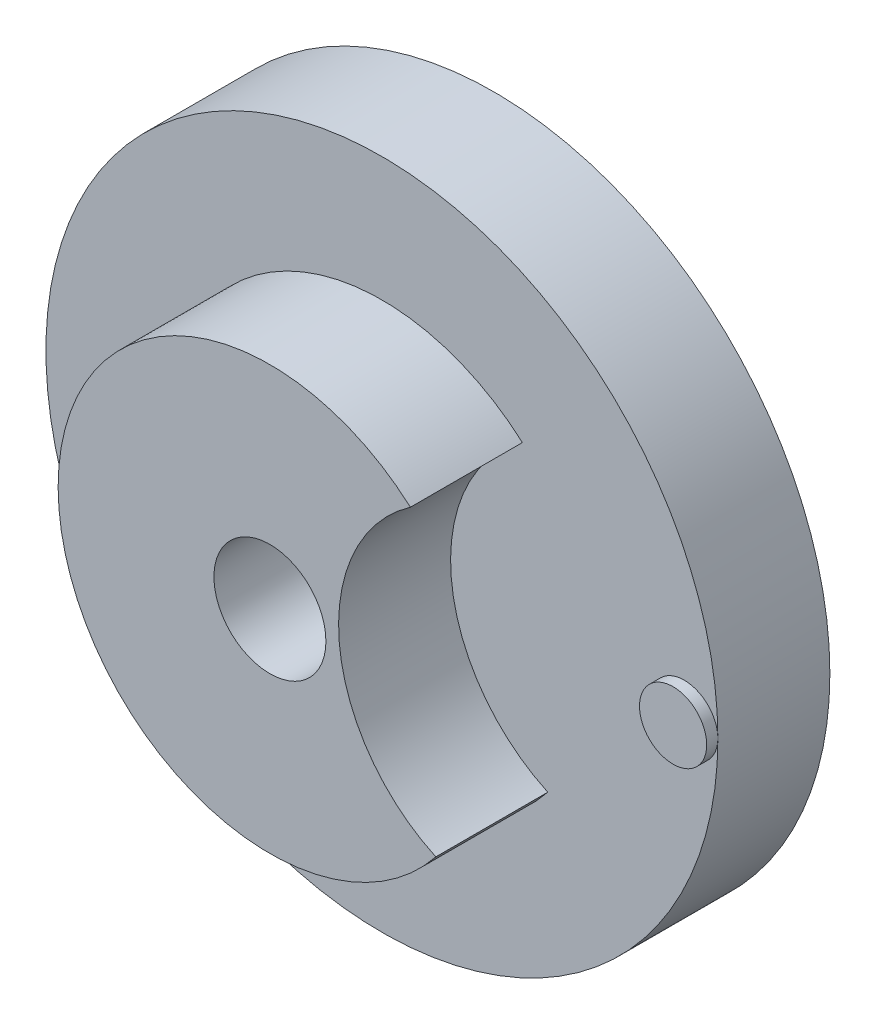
ISO-10303-21;
HEADER;
FILE_DESCRIPTION(('STEP AP214'),'2;1');
FILE_NAME('part.step','',(''),(''),'','','');
FILE_SCHEMA(('AUTOMOTIVE_DESIGN { 1 0 10303 214 1 1 1 1 }'));
ENDSEC;
DATA;
#1=APPLICATION_CONTEXT('core data for automotive mechanical design processes');
#2=APPLICATION_PROTOCOL_DEFINITION('international standard','automotive_design',2000,#1);
#3=PRODUCT_CONTEXT('',#1,'mechanical');
#4=PRODUCT('Part','Part','',(#3));
#5=PRODUCT_RELATED_PRODUCT_CATEGORY('part','',(#4));
#6=PRODUCT_DEFINITION_FORMATION('','',#4);
#7=PRODUCT_DEFINITION_CONTEXT('part definition',#1,'design');
#8=PRODUCT_DEFINITION('design','',#6,#7);
#9=PRODUCT_DEFINITION_SHAPE('','',#8);
#10=(LENGTH_UNIT() NAMED_UNIT(*) SI_UNIT(.MILLI.,.METRE.));
#11=(NAMED_UNIT(*) PLANE_ANGLE_UNIT() SI_UNIT($,.RADIAN.));
#12=(NAMED_UNIT(*) SI_UNIT($,.STERADIAN.) SOLID_ANGLE_UNIT());
#13=UNCERTAINTY_MEASURE_WITH_UNIT(LENGTH_MEASURE(1.E-05),#10,'distance_accuracy_value','');
#14=(GEOMETRIC_REPRESENTATION_CONTEXT(3) GLOBAL_UNCERTAINTY_ASSIGNED_CONTEXT((#13)) GLOBAL_UNIT_ASSIGNED_CONTEXT((#10,
#11,#12)) REPRESENTATION_CONTEXT('',''));
#15=CARTESIAN_POINT('',(0.,0.,0.));
#16=DIRECTION('',(0.,0.,1.));
#17=DIRECTION('',(1.,0.,0.));
#18=AXIS2_PLACEMENT_3D('',#15,#16,#17);
#19=CARTESIAN_POINT('',(0.,0.,10.));
#20=DIRECTION('',(0.,0.,1.));
#21=DIRECTION('',(1.,0.,0.));
#22=AXIS2_PLACEMENT_3D('',#19,#20,#21);
#23=PLANE('',#22);
#24=CARTESIAN_POINT('',(0.,0.,10.));
#25=DIRECTION('',(0.,0.,1.));
#26=DIRECTION('',(1.,0.,0.));
#27=AXIS2_PLACEMENT_3D('',#24,#25,#26);
#28=CIRCLE('',#27,30.);
#29=CARTESIAN_POINT('',(30.,0.,10.));
#30=VERTEX_POINT('',#29);
#31=EDGE_CURVE('E11',#30,#30,#28,.T.);
#32=ORIENTED_EDGE('',*,*,#31,.T.);
#33=CARTESIAN_POINT('',(27.,0.,10.));
#34=DIRECTION('',(0.,0.,1.));
#35=DIRECTION('',(1.,0.,0.));
#36=AXIS2_PLACEMENT_3D('',#33,#34,#35);
#37=CIRCLE('',#36,3.);
#38=EDGE_CURVE('E51',#30,#30,#37,.T.);
#39=ORIENTED_EDGE('',*,*,#38,.F.);
#40=EDGE_LOOP('',(#32,#39));
#41=FACE_BOUND('',#40,.T.);
#42=CARTESIAN_POINT('',(0.,0.,10.));
#43=DIRECTION('',(0.,0.,1.));
#44=DIRECTION('',(1.,0.,0.));
#45=AXIS2_PLACEMENT_3D('',#42,#43,#44);
#46=CIRCLE('',#45,18.91);
#47=CARTESIAN_POINT('',(12.5463626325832,14.1483880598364,10.));
#48=VERTEX_POINT('',#47);
#49=CARTESIAN_POINT('',(14.8125969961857,-11.7547892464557,10.));
#50=VERTEX_POINT('',#49);
#51=EDGE_CURVE('E81',#48,#50,#46,.T.);
#52=ORIENTED_EDGE('',*,*,#51,.F.);
#53=CARTESIAN_POINT('',(21.1324807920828,1.84885250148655,10.));
#54=DIRECTION('',(0.,0.,1.));
#55=DIRECTION('',(1.,0.,0.));
#56=AXIS2_PLACEMENT_3D('',#53,#54,#55);
#57=CIRCLE('',#56,15.);
#58=EDGE_CURVE('E82',#50,#48,#57,.F.);
#59=ORIENTED_EDGE('',*,*,#58,.F.);
#60=EDGE_LOOP('',(#52,#59));
#61=FACE_BOUND('',#60,.T.);
#62=ADVANCED_FACE('F38',(#41,#61),#23,.T.);
#63=CARTESIAN_POINT('',(0.,0.,0.));
#64=DIRECTION('',(0.,0.,1.));
#65=DIRECTION('',(1.,0.,0.));
#66=AXIS2_PLACEMENT_3D('',#63,#64,#65);
#67=PLANE('',#66);
#68=CARTESIAN_POINT('',(0.,0.,0.));
#69=DIRECTION('',(0.,0.,1.));
#70=DIRECTION('',(1.,0.,0.));
#71=AXIS2_PLACEMENT_3D('',#68,#69,#70);
#72=CIRCLE('',#71,30.);
#73=CARTESIAN_POINT('',(30.,0.,0.));
#74=VERTEX_POINT('',#73);
#75=EDGE_CURVE('E42',#74,#74,#72,.T.);
#76=ORIENTED_EDGE('',*,*,#75,.F.);
#77=EDGE_LOOP('',(#76));
#78=FACE_BOUND('',#77,.T.);
#79=CARTESIAN_POINT('',(0.,0.,0.));
#80=DIRECTION('',(0.,0.,1.));
#81=DIRECTION('',(1.,0.,0.));
#82=AXIS2_PLACEMENT_3D('',#79,#80,#81);
#83=CIRCLE('',#82,5.);
#84=CARTESIAN_POINT('',(5.,0.,0.));
#85=VERTEX_POINT('',#84);
#86=EDGE_CURVE('E86',#85,#85,#83,.T.);
#87=ORIENTED_EDGE('',*,*,#86,.T.);
#88=EDGE_LOOP('',(#87));
#89=FACE_BOUND('',#88,.T.);
#90=ADVANCED_FACE('F113',(#78,#89),#67,.F.);
#91=CARTESIAN_POINT('',(0.,0.,10.));
#92=DIRECTION('',(0.,0.,-1.));
#93=DIRECTION('',(-1.,0.,0.));
#94=AXIS2_PLACEMENT_3D('',#91,#92,#93);
#95=CYLINDRICAL_SURFACE('',#94,30.);
#96=ORIENTED_EDGE('',*,*,#31,.F.);
#97=EDGE_LOOP('',(#96));
#98=FACE_BOUND('',#97,.T.);
#99=ORIENTED_EDGE('',*,*,#75,.T.);
#100=EDGE_LOOP('',(#99));
#101=FACE_BOUND('',#100,.T.);
#102=ADVANCED_FACE('F40',(#98,#101),#95,.T.);
#103=CARTESIAN_POINT('',(0.,0.,10.));
#104=DIRECTION('',(0.,0.,-1.));
#105=DIRECTION('',(-1.,0.,0.));
#106=AXIS2_PLACEMENT_3D('',#103,#104,#105);
#107=CYLINDRICAL_SURFACE('',#106,5.);
#108=ORIENTED_EDGE('',*,*,#86,.F.);
#109=EDGE_LOOP('',(#108));
#110=FACE_BOUND('',#109,.T.);
#111=CARTESIAN_POINT('',(0.,0.,20.));
#112=DIRECTION('',(0.,0.,1.));
#113=DIRECTION('',(1.,0.,0.));
#114=AXIS2_PLACEMENT_3D('',#111,#112,#113);
#115=CIRCLE('',#114,5.);
#116=CARTESIAN_POINT('',(5.,0.,20.));
#117=VERTEX_POINT('',#116);
#118=EDGE_CURVE('E90',#117,#117,#115,.T.);
#119=ORIENTED_EDGE('',*,*,#118,.T.);
#120=EDGE_LOOP('',(#119));
#121=FACE_BOUND('',#120,.T.);
#122=ADVANCED_FACE('F122',(#110,#121),#107,.F.);
#123=CARTESIAN_POINT('',(0.,0.,20.));
#124=DIRECTION('',(0.,0.,-1.));
#125=DIRECTION('',(-1.,0.,0.));
#126=AXIS2_PLACEMENT_3D('',#123,#124,#125);
#127=CYLINDRICAL_SURFACE('',#126,18.91);
#128=ORIENTED_EDGE('',*,*,#51,.T.);
#129=DIRECTION('',(0.,0.,1.));
#130=VECTOR('',#129,1.);
#131=CARTESIAN_POINT('',(14.8125969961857,-11.7547892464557,-18.8832060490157));
#132=LINE('',#131,#130);
#133=CARTESIAN_POINT('',(14.8125969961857,-11.7547892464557,20.));
#134=VERTEX_POINT('',#133);
#135=EDGE_CURVE('E69',#50,#134,#132,.T.);
#136=ORIENTED_EDGE('',*,*,#135,.T.);
#137=CARTESIAN_POINT('',(0.,0.,20.));
#138=DIRECTION('',(0.,0.,1.));
#139=DIRECTION('',(1.,0.,0.));
#140=AXIS2_PLACEMENT_3D('',#137,#138,#139);
#141=CIRCLE('',#140,18.91);
#142=CARTESIAN_POINT('',(12.5463626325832,14.1483880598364,20.));
#143=VERTEX_POINT('',#142);
#144=EDGE_CURVE('E79',#143,#134,#141,.T.);
#145=ORIENTED_EDGE('',*,*,#144,.F.);
#146=DIRECTION('',(0.,0.,1.));
#147=VECTOR('',#146,1.);
#148=CARTESIAN_POINT('',(12.5463626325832,14.1483880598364,-18.8832060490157));
#149=LINE('',#148,#147);
#150=EDGE_CURVE('E58',#48,#143,#149,.T.);
#151=ORIENTED_EDGE('',*,*,#150,.F.);
#152=EDGE_LOOP('',(#128,#136,#145,#151));
#153=FACE_BOUND('',#152,.T.);
#154=ADVANCED_FACE('F78',(#153),#127,.T.);
#155=CARTESIAN_POINT('',(0.,0.,20.));
#156=DIRECTION('',(0.,0.,1.));
#157=DIRECTION('',(1.,0.,0.));
#158=AXIS2_PLACEMENT_3D('',#155,#156,#157);
#159=PLANE('',#158);
#160=CARTESIAN_POINT('',(21.1324807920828,1.84885250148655,20.));
#161=DIRECTION('',(0.,0.,1.));
#162=DIRECTION('',(1.,0.,0.));
#163=AXIS2_PLACEMENT_3D('',#160,#161,#162);
#164=CIRCLE('',#163,15.);
#165=EDGE_CURVE('E66',#143,#134,#164,.T.);
#166=ORIENTED_EDGE('',*,*,#165,.F.);
#167=ORIENTED_EDGE('',*,*,#144,.T.);
#168=EDGE_LOOP('',(#166,#167));
#169=FACE_BOUND('',#168,.T.);
#170=ORIENTED_EDGE('',*,*,#118,.F.);
#171=EDGE_LOOP('',(#170));
#172=FACE_BOUND('',#171,.T.);
#173=ADVANCED_FACE('F84',(#169,#172),#159,.T.);
#174=CARTESIAN_POINT('',(21.1324807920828,1.84885250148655,-18.8832060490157));
#175=DIRECTION('',(0.,0.,1.));
#176=DIRECTION('',(1.,0.,0.));
#177=AXIS2_PLACEMENT_3D('',#174,#175,#176);
#178=CYLINDRICAL_SURFACE('',#177,15.);
#179=ORIENTED_EDGE('',*,*,#58,.T.);
#180=ORIENTED_EDGE('',*,*,#150,.T.);
#181=ORIENTED_EDGE('',*,*,#165,.T.);
#182=ORIENTED_EDGE('',*,*,#135,.F.);
#183=EDGE_LOOP('',(#179,#180,#181,#182));
#184=FACE_BOUND('',#183,.T.);
#185=ADVANCED_FACE('F68',(#184),#178,.F.);
#186=CARTESIAN_POINT('',(27.,0.,11.));
#187=DIRECTION('',(0.,0.,-1.));
#188=DIRECTION('',(-1.,0.,0.));
#189=AXIS2_PLACEMENT_3D('',#186,#187,#188);
#190=CYLINDRICAL_SURFACE('',#189,3.);
#191=CARTESIAN_POINT('',(27.,0.,11.));
#192=DIRECTION('',(0.,0.,1.));
#193=DIRECTION('',(1.,0.,0.));
#194=AXIS2_PLACEMENT_3D('',#191,#192,#193);
#195=CIRCLE('',#194,3.);
#196=CARTESIAN_POINT('',(30.,0.,11.));
#197=VERTEX_POINT('',#196);
#198=EDGE_CURVE('E74',#197,#197,#195,.T.);
#199=ORIENTED_EDGE('',*,*,#198,.F.);
#200=EDGE_LOOP('',(#199));
#201=FACE_BOUND('',#200,.T.);
#202=ORIENTED_EDGE('',*,*,#38,.T.);
#203=EDGE_LOOP('',(#202));
#204=FACE_BOUND('',#203,.T.);
#205=ADVANCED_FACE('F103',(#201,#204),#190,.T.);
#206=CARTESIAN_POINT('',(27.,0.,11.));
#207=DIRECTION('',(0.,0.,1.));
#208=DIRECTION('',(1.,0.,0.));
#209=AXIS2_PLACEMENT_3D('',#206,#207,#208);
#210=PLANE('',#209);
#211=ORIENTED_EDGE('',*,*,#198,.T.);
#212=EDGE_LOOP('',(#211));
#213=FACE_BOUND('',#212,.T.);
#214=ADVANCED_FACE('F101',(#213),#210,.T.);
#215=CLOSED_SHELL('',(#62,#90,#102,#122,#154,#173,#185,#205,#214));
#216=MANIFOLD_SOLID_BREP('B2',#215);
#217=ADVANCED_BREP_SHAPE_REPRESENTATION('',(#18,#216),#14);
#218=SHAPE_DEFINITION_REPRESENTATION(#9,#217);
ENDSEC;
END-ISO-10303-21;
